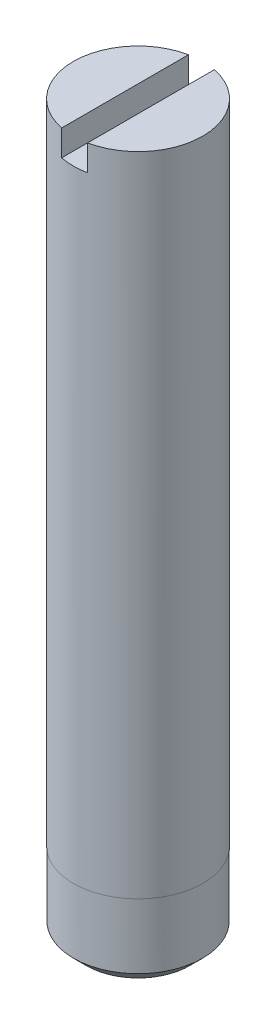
from build123d import *

# Parameters (mm, degrees)
SKETCH1_R          = 2.5
EXTRUDE1_DEPTH     = 28
CUT_EXTRUDE1_DEPTH = 1
CHAMFER1_SIZE      = 0.5
SKETCH3_R          = 2.5
SKETCH3_R_2        = 2.49
CUT_EXTRUDE2_DEPTH = 3


with BuildPart() as part:
    # Sketch1 → Extrude1 (new body)
    with BuildSketch(Plane(origin=(0, 0, 0), x_dir=(1, 0, 0), z_dir=(0, 1, 0))):
        with Locations(Location((0, 0, 0), (0, 0, 270))):
            Circle(SKETCH1_R)
    extrude(amount=EXTRUDE1_DEPTH)

    # Sketch2 → Cut-Extrude1 (cut)
    with BuildSketch(Plane(origin=(0, 28, 0), x_dir=(-1, 0, 0), z_dir=(0, 1, 0))):
        Polygon((0.5, -3.585460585), (0.5, 3.889747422), (-0.5, 4.007643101), (-0.5, -3.585460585), align=None)
    extrude(amount=-CUT_EXTRUDE1_DEPTH, mode=Mode.SUBTRACT)

    # Chamfer1
    chamfer1_edges = [part.edges().sort_by_distance(p)[0] for p in [
        (0, 0, -2.5),
    ]]
    chamfer(chamfer1_edges, length=CHAMFER1_SIZE)

    # Sketch3 → Cut-Extrude2 (cut)
    with BuildSketch(Plane.XZ):
        with Locations(Location((0, 0, 0), (0, 0, 270))):
            Circle(SKETCH3_R)
        with Locations(Location((0, 0, 0), (0, 0, 270))):
            Circle(SKETCH3_R_2, mode=Mode.SUBTRACT)
    extrude(amount=-CUT_EXTRUDE2_DEPTH, mode=Mode.SUBTRACT)


solid = part.part
